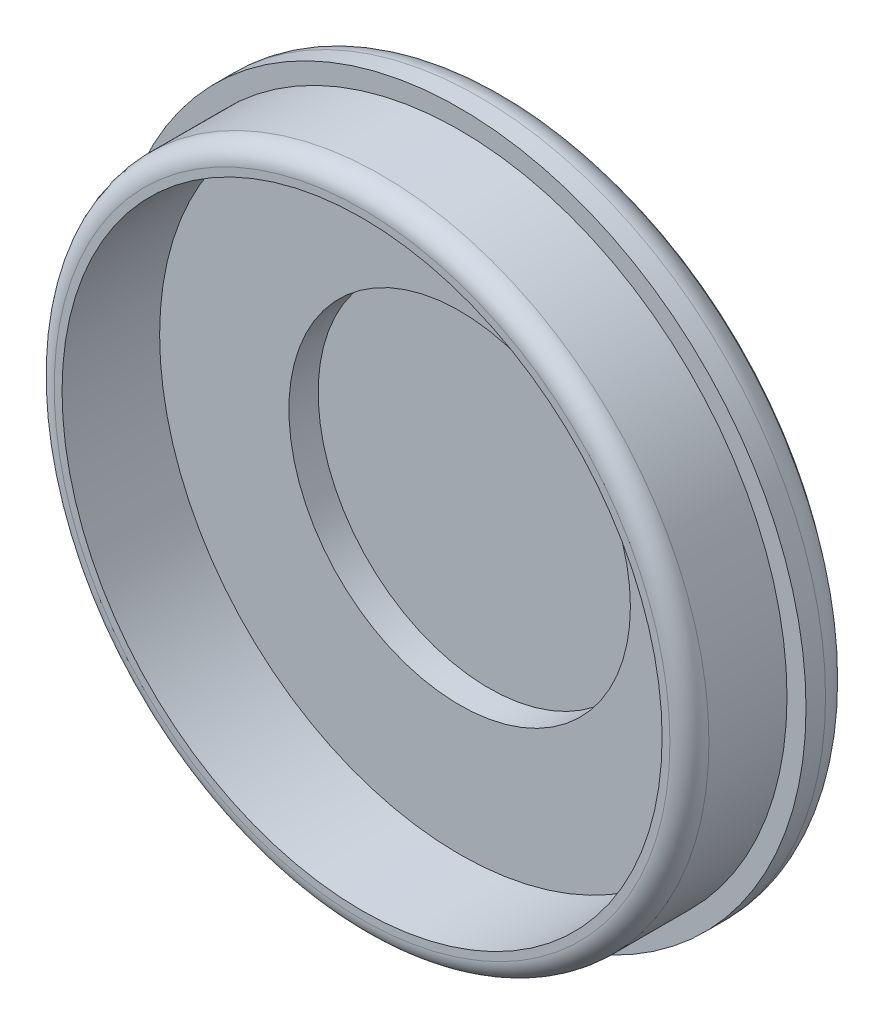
ISO-10303-21;
HEADER;
FILE_DESCRIPTION(('STEP AP214'),'2;1');
FILE_NAME('part.step','',(''),(''),'','','');
FILE_SCHEMA(('AUTOMOTIVE_DESIGN { 1 0 10303 214 1 1 1 1 }'));
ENDSEC;
DATA;
#1=APPLICATION_CONTEXT('core data for automotive mechanical design processes');
#2=APPLICATION_PROTOCOL_DEFINITION('international standard','automotive_design',2000,#1);
#3=PRODUCT_CONTEXT('',#1,'mechanical');
#4=PRODUCT('Part','Part','',(#3));
#5=PRODUCT_RELATED_PRODUCT_CATEGORY('part','',(#4));
#6=PRODUCT_DEFINITION_FORMATION('','',#4);
#7=PRODUCT_DEFINITION_CONTEXT('part definition',#1,'design');
#8=PRODUCT_DEFINITION('design','',#6,#7);
#9=PRODUCT_DEFINITION_SHAPE('','',#8);
#10=(LENGTH_UNIT() NAMED_UNIT(*) SI_UNIT(.MILLI.,.METRE.));
#11=(NAMED_UNIT(*) PLANE_ANGLE_UNIT() SI_UNIT($,.RADIAN.));
#12=(NAMED_UNIT(*) SI_UNIT($,.STERADIAN.) SOLID_ANGLE_UNIT());
#13=UNCERTAINTY_MEASURE_WITH_UNIT(LENGTH_MEASURE(1.E-05),#10,'distance_accuracy_value','');
#14=(GEOMETRIC_REPRESENTATION_CONTEXT(3) GLOBAL_UNCERTAINTY_ASSIGNED_CONTEXT((#13)) GLOBAL_UNIT_ASSIGNED_CONTEXT((#10,
#11,#12)) REPRESENTATION_CONTEXT('',''));
#15=CARTESIAN_POINT('',(0.,0.,0.));
#16=DIRECTION('',(0.,0.,1.));
#17=DIRECTION('',(1.,0.,0.));
#18=AXIS2_PLACEMENT_3D('',#15,#16,#17);
#19=CARTESIAN_POINT('',(0.,0.,0.));
#20=DIRECTION('',(0.,0.,1.));
#21=DIRECTION('',(1.,0.,0.));
#22=AXIS2_PLACEMENT_3D('',#19,#20,#21);
#23=PLANE('',#22);
#24=CARTESIAN_POINT('',(0.,0.,0.));
#25=DIRECTION('',(0.,0.,1.));
#26=DIRECTION('',(1.,0.,0.));
#27=AXIS2_PLACEMENT_3D('',#24,#25,#26);
#28=CIRCLE('',#27,33.55);
#29=CARTESIAN_POINT('',(33.55,0.,0.));
#30=VERTEX_POINT('',#29);
#31=EDGE_CURVE('E53',#30,#30,#28,.T.);
#32=ORIENTED_EDGE('',*,*,#31,.F.);
#33=EDGE_LOOP('',(#32));
#34=FACE_BOUND('',#33,.T.);
#35=ADVANCED_FACE('F31',(#34),#23,.F.);
#36=CARTESIAN_POINT('',(0.,0.,15.));
#37=DIRECTION('',(0.,0.,-1.));
#38=DIRECTION('',(-1.,0.,0.));
#39=AXIS2_PLACEMENT_3D('',#36,#37,#38);
#40=CYLINDRICAL_SURFACE('',#39,33.55);
#41=CARTESIAN_POINT('',(0.,0.,0.189750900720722));
#42=DIRECTION('',(0.,0.,1.));
#43=DIRECTION('',(1.,0.,0.));
#44=AXIS2_PLACEMENT_3D('',#41,#42,#43);
#45=CIRCLE('',#44,33.55);
#46=CARTESIAN_POINT('',(33.55,0.,0.189750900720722));
#47=VERTEX_POINT('',#46);
#48=EDGE_CURVE('E49',#47,#47,#45,.T.);
#49=ORIENTED_EDGE('',*,*,#48,.F.);
#50=EDGE_LOOP('',(#49));
#51=FACE_BOUND('',#50,.T.);
#52=ORIENTED_EDGE('',*,*,#31,.T.);
#53=EDGE_LOOP('',(#52));
#54=FACE_BOUND('',#53,.T.);
#55=ADVANCED_FACE('F97',(#51,#54),#40,.T.);
#56=CARTESIAN_POINT('',(0.,0.,5.));
#57=DIRECTION('',(0.,0.,1.));
#58=DIRECTION('',(1.,0.,0.));
#59=AXIS2_PLACEMENT_3D('',#56,#57,#58);
#60=PLANE('',#59);
#61=CARTESIAN_POINT('',(0.,0.,5.));
#62=DIRECTION('',(0.,0.,1.));
#63=DIRECTION('',(1.,0.,0.));
#64=AXIS2_PLACEMENT_3D('',#61,#62,#63);
#65=CIRCLE('',#64,35.5);
#66=CARTESIAN_POINT('',(35.5,0.,5.));
#67=VERTEX_POINT('',#66);
#68=EDGE_CURVE('E56',#67,#67,#65,.T.);
#69=ORIENTED_EDGE('',*,*,#68,.T.);
#70=EDGE_LOOP('',(#69));
#71=FACE_BOUND('',#70,.T.);
#72=CARTESIAN_POINT('',(0.,0.,5.));
#73=DIRECTION('',(0.,0.,1.));
#74=DIRECTION('',(1.,0.,0.));
#75=AXIS2_PLACEMENT_3D('',#72,#73,#74);
#76=CIRCLE('',#75,33.55);
#77=CARTESIAN_POINT('',(33.55,0.,5.));
#78=VERTEX_POINT('',#77);
#79=EDGE_CURVE('E52',#78,#78,#76,.F.);
#80=ORIENTED_EDGE('',*,*,#79,.T.);
#81=EDGE_LOOP('',(#80));
#82=FACE_BOUND('',#81,.T.);
#83=ADVANCED_FACE('F80',(#71,#82),#60,.T.);
#84=CARTESIAN_POINT('',(0.,0.,5.));
#85=DIRECTION('',(0.,0.,-1.));
#86=DIRECTION('',(-1.,0.,0.));
#87=AXIS2_PLACEMENT_3D('',#84,#85,#86);
#88=CYLINDRICAL_SURFACE('',#87,35.5);
#89=CARTESIAN_POINT('',(0.,0.,3.));
#90=DIRECTION('',(0.,0.,1.));
#91=DIRECTION('',(1.,0.,0.));
#92=AXIS2_PLACEMENT_3D('',#89,#90,#91);
#93=CIRCLE('',#92,35.5);
#94=CARTESIAN_POINT('',(35.5,0.,3.));
#95=VERTEX_POINT('',#94);
#96=EDGE_CURVE('E46',#95,#95,#93,.T.);
#97=ORIENTED_EDGE('',*,*,#96,.T.);
#98=EDGE_LOOP('',(#97));
#99=FACE_BOUND('',#98,.T.);
#100=ORIENTED_EDGE('',*,*,#68,.F.);
#101=EDGE_LOOP('',(#100));
#102=FACE_BOUND('',#101,.T.);
#103=ADVANCED_FACE('F107',(#99,#102),#88,.T.);
#104=CARTESIAN_POINT('',(0.,0.,3.));
#105=DIRECTION('',(0.,0.,1.));
#106=DIRECTION('',(1.,0.,0.));
#107=AXIS2_PLACEMENT_3D('',#104,#105,#106);
#108=TOROIDAL_SURFACE('',#107,32.5,3.);
#109=ORIENTED_EDGE('',*,*,#96,.F.);
#110=EDGE_LOOP('',(#109));
#111=FACE_BOUND('',#110,.T.);
#112=ORIENTED_EDGE('',*,*,#48,.T.);
#113=EDGE_LOOP('',(#112));
#114=FACE_BOUND('',#113,.T.);
#115=ADVANCED_FACE('F95',(#111,#114),#108,.T.);
#116=CARTESIAN_POINT('',(0.,0.,13.));
#117=DIRECTION('',(0.,0.,1.));
#118=DIRECTION('',(1.,0.,0.));
#119=AXIS2_PLACEMENT_3D('',#116,#117,#118);
#120=CIRCLE('',#119,33.55);
#121=CARTESIAN_POINT('',(33.55,0.,13.));
#122=VERTEX_POINT('',#121);
#123=EDGE_CURVE('E10',#122,#122,#120,.F.);
#124=ORIENTED_EDGE('',*,*,#123,.T.);
#125=EDGE_LOOP('',(#124));
#126=FACE_BOUND('',#125,.T.);
#127=ORIENTED_EDGE('',*,*,#79,.F.);
#128=EDGE_LOOP('',(#127));
#129=FACE_BOUND('',#128,.T.);
#130=ADVANCED_FACE('F90',(#126,#129),#40,.T.);
#131=CARTESIAN_POINT('',(0.,0.,15.));
#132=DIRECTION('',(0.,0.,1.));
#133=DIRECTION('',(1.,0.,0.));
#134=AXIS2_PLACEMENT_3D('',#131,#132,#133);
#135=PLANE('',#134);
#136=CARTESIAN_POINT('',(0.,0.,15.));
#137=DIRECTION('',(0.,0.,1.));
#138=DIRECTION('',(1.,0.,0.));
#139=AXIS2_PLACEMENT_3D('',#136,#137,#138);
#140=CIRCLE('',#139,31.55);
#141=CARTESIAN_POINT('',(31.55,0.,15.));
#142=VERTEX_POINT('',#141);
#143=EDGE_CURVE('E38',#142,#142,#140,.T.);
#144=ORIENTED_EDGE('',*,*,#143,.T.);
#145=EDGE_LOOP('',(#144));
#146=FACE_BOUND('',#145,.T.);
#147=CARTESIAN_POINT('',(0.,0.,15.));
#148=DIRECTION('',(0.,0.,1.));
#149=DIRECTION('',(1.,0.,0.));
#150=AXIS2_PLACEMENT_3D('',#147,#148,#149);
#151=CIRCLE('',#150,30.75);
#152=CARTESIAN_POINT('',(30.75,0.,15.));
#153=VERTEX_POINT('',#152);
#154=EDGE_CURVE('E63',#153,#153,#151,.T.);
#155=ORIENTED_EDGE('',*,*,#154,.F.);
#156=EDGE_LOOP('',(#155));
#157=FACE_BOUND('',#156,.T.);
#158=ADVANCED_FACE('F85',(#146,#157),#135,.T.);
#159=CARTESIAN_POINT('',(0.,0.,15.));
#160=DIRECTION('',(0.,0.,-1.));
#161=DIRECTION('',(-1.,0.,0.));
#162=AXIS2_PLACEMENT_3D('',#159,#160,#161);
#163=CYLINDRICAL_SURFACE('',#162,30.75);
#164=CARTESIAN_POINT('',(0.,0.,5.));
#165=DIRECTION('',(0.,0.,1.));
#166=DIRECTION('',(1.,0.,0.));
#167=AXIS2_PLACEMENT_3D('',#164,#165,#166);
#168=CIRCLE('',#167,30.75);
#169=CARTESIAN_POINT('',(30.75,0.,5.));
#170=VERTEX_POINT('',#169);
#171=EDGE_CURVE('E42',#170,#170,#168,.F.);
#172=ORIENTED_EDGE('',*,*,#171,.T.);
#173=EDGE_LOOP('',(#172));
#174=FACE_BOUND('',#173,.T.);
#175=ORIENTED_EDGE('',*,*,#154,.T.);
#176=EDGE_LOOP('',(#175));
#177=FACE_BOUND('',#176,.T.);
#178=ADVANCED_FACE('F78',(#174,#177),#163,.F.);
#179=CARTESIAN_POINT('',(0.,0.,5.));
#180=DIRECTION('',(0.,0.,1.));
#181=DIRECTION('',(1.,0.,0.));
#182=AXIS2_PLACEMENT_3D('',#179,#180,#181);
#183=CIRCLE('',#182,17.5);
#184=CARTESIAN_POINT('',(17.5,0.,5.));
#185=VERTEX_POINT('',#184);
#186=EDGE_CURVE('E69',#185,#185,#183,.T.);
#187=ORIENTED_EDGE('',*,*,#186,.F.);
#188=EDGE_LOOP('',(#187));
#189=FACE_BOUND('',#188,.T.);
#190=ORIENTED_EDGE('',*,*,#171,.F.);
#191=EDGE_LOOP('',(#190));
#192=FACE_BOUND('',#191,.T.);
#193=ADVANCED_FACE('F75',(#189,#192),#60,.T.);
#194=CARTESIAN_POINT('',(0.,0.,13.));
#195=DIRECTION('',(0.,0.,1.));
#196=DIRECTION('',(1.,0.,0.));
#197=AXIS2_PLACEMENT_3D('',#194,#195,#196);
#198=TOROIDAL_SURFACE('',#197,31.55,2.);
#199=ORIENTED_EDGE('',*,*,#123,.F.);
#200=EDGE_LOOP('',(#199));
#201=FACE_BOUND('',#200,.T.);
#202=ORIENTED_EDGE('',*,*,#143,.F.);
#203=EDGE_LOOP('',(#202));
#204=FACE_BOUND('',#203,.T.);
#205=ADVANCED_FACE('F33',(#201,#204),#198,.T.);
#206=CARTESIAN_POINT('',(0.,0.,2.));
#207=DIRECTION('',(0.,0.,-1.));
#208=DIRECTION('',(-1.,0.,0.));
#209=AXIS2_PLACEMENT_3D('',#206,#207,#208);
#210=PLANE('',#209);
#211=CARTESIAN_POINT('',(0.,0.,2.));
#212=DIRECTION('',(0.,0.,1.));
#213=DIRECTION('',(1.,0.,0.));
#214=AXIS2_PLACEMENT_3D('',#211,#212,#213);
#215=CIRCLE('',#214,17.5);
#216=CARTESIAN_POINT('',(17.5,0.,2.));
#217=VERTEX_POINT('',#216);
#218=EDGE_CURVE('E66',#217,#217,#215,.T.);
#219=ORIENTED_EDGE('',*,*,#218,.T.);
#220=EDGE_LOOP('',(#219));
#221=FACE_BOUND('',#220,.T.);
#222=ADVANCED_FACE('F166',(#221),#210,.F.);
#223=CARTESIAN_POINT('',(0.,0.,5.));
#224=DIRECTION('',(0.,0.,1.));
#225=DIRECTION('',(1.,0.,0.));
#226=AXIS2_PLACEMENT_3D('',#223,#224,#225);
#227=CYLINDRICAL_SURFACE('',#226,17.5);
#228=ORIENTED_EDGE('',*,*,#218,.F.);
#229=EDGE_LOOP('',(#228));
#230=FACE_BOUND('',#229,.T.);
#231=ORIENTED_EDGE('',*,*,#186,.T.);
#232=EDGE_LOOP('',(#231));
#233=FACE_BOUND('',#232,.T.);
#234=ADVANCED_FACE('F73',(#230,#233),#227,.F.);
#235=CLOSED_SHELL('',(#35,#55,#83,#103,#115,#130,#158,#178,#193,#205,#222,#234));
#236=MANIFOLD_SOLID_BREP('B2',#235);
#237=ADVANCED_BREP_SHAPE_REPRESENTATION('',(#18,#236),#14);
#238=SHAPE_DEFINITION_REPRESENTATION(#9,#237);
ENDSEC;
END-ISO-10303-21;
